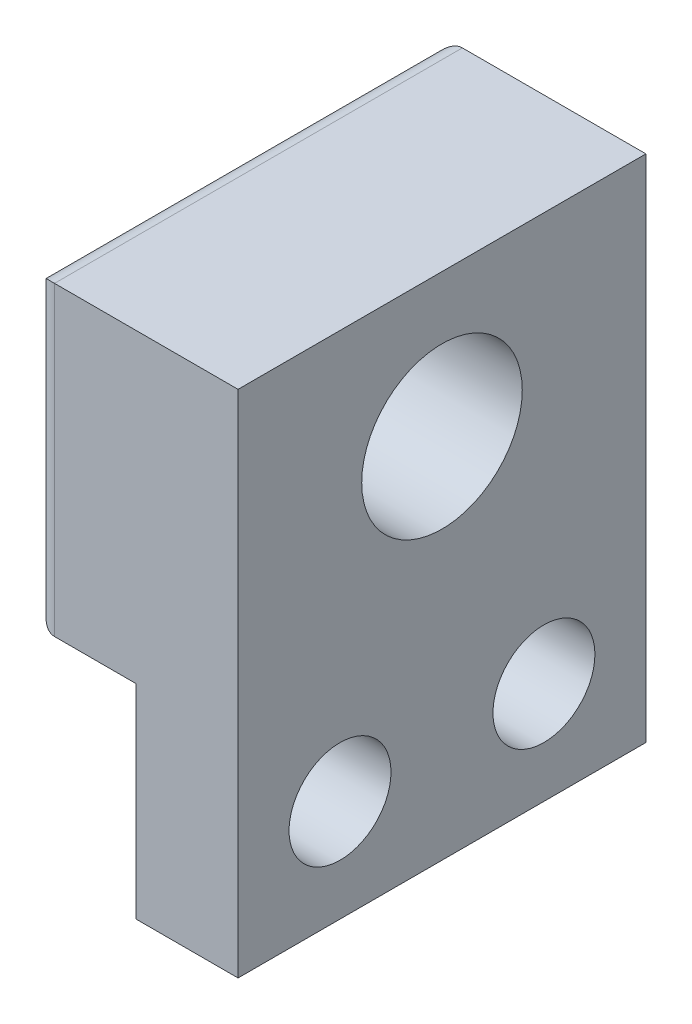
ISO-10303-21;
HEADER;
FILE_DESCRIPTION(('STEP AP214'),'2;1');
FILE_NAME('part.step','',(''),(''),'','','');
FILE_SCHEMA(('AUTOMOTIVE_DESIGN { 1 0 10303 214 1 1 1 1 }'));
ENDSEC;
DATA;
#1=APPLICATION_CONTEXT('core data for automotive mechanical design processes');
#2=APPLICATION_PROTOCOL_DEFINITION('international standard','automotive_design',2000,#1);
#3=PRODUCT_CONTEXT('',#1,'mechanical');
#4=PRODUCT('Part','Part','',(#3));
#5=PRODUCT_RELATED_PRODUCT_CATEGORY('part','',(#4));
#6=PRODUCT_DEFINITION_FORMATION('','',#4);
#7=PRODUCT_DEFINITION_CONTEXT('part definition',#1,'design');
#8=PRODUCT_DEFINITION('design','',#6,#7);
#9=PRODUCT_DEFINITION_SHAPE('','',#8);
#10=(LENGTH_UNIT() NAMED_UNIT(*) SI_UNIT(.MILLI.,.METRE.));
#11=(NAMED_UNIT(*) PLANE_ANGLE_UNIT() SI_UNIT($,.RADIAN.));
#12=(NAMED_UNIT(*) SI_UNIT($,.STERADIAN.) SOLID_ANGLE_UNIT());
#13=UNCERTAINTY_MEASURE_WITH_UNIT(LENGTH_MEASURE(1.E-05),#10,'distance_accuracy_value','');
#14=(GEOMETRIC_REPRESENTATION_CONTEXT(3) GLOBAL_UNCERTAINTY_ASSIGNED_CONTEXT((#13)) GLOBAL_UNIT_ASSIGNED_CONTEXT((#10,
#11,#12)) REPRESENTATION_CONTEXT('',''));
#15=CARTESIAN_POINT('',(0.,0.,0.));
#16=DIRECTION('',(0.,0.,1.));
#17=DIRECTION('',(1.,0.,0.));
#18=AXIS2_PLACEMENT_3D('',#15,#16,#17);
#19=CARTESIAN_POINT('',(-12.7,0.,-25.4));
#20=DIRECTION('',(1.,0.,0.));
#21=DIRECTION('',(0.,0.,-1.));
#22=AXIS2_PLACEMENT_3D('',#19,#20,#21);
#23=PLANE('',#22);
#24=DIRECTION('',(0.,0.,1.));
#25=VECTOR('',#24,1.);
#26=CARTESIAN_POINT('',(-12.7,1.27,-25.4));
#27=LINE('',#26,#25);
#28=CARTESIAN_POINT('',(-12.7,1.27,-24.13));
#29=VERTEX_POINT('',#28);
#30=CARTESIAN_POINT('',(-12.7,1.27,-1.27));
#31=VERTEX_POINT('',#30);
#32=EDGE_CURVE('E170',#29,#31,#27,.T.);
#33=ORIENTED_EDGE('',*,*,#32,.T.);
#34=DIRECTION('',(0.,1.,0.));
#35=VECTOR('',#34,1.);
#36=CARTESIAN_POINT('',(-12.7,19.05,-1.27));
#37=LINE('',#36,#35);
#38=CARTESIAN_POINT('',(-12.7,17.78,-1.27));
#39=VERTEX_POINT('',#38);
#40=EDGE_CURVE('E172',#31,#39,#37,.T.);
#41=ORIENTED_EDGE('',*,*,#40,.T.);
#42=DIRECTION('',(0.,0.,1.));
#43=VECTOR('',#42,1.);
#44=CARTESIAN_POINT('',(-12.7,17.78,-25.4));
#45=LINE('',#44,#43);
#46=CARTESIAN_POINT('',(-12.7,17.78,-24.13));
#47=VERTEX_POINT('',#46);
#48=EDGE_CURVE('E155',#39,#47,#45,.F.);
#49=ORIENTED_EDGE('',*,*,#48,.T.);
#50=DIRECTION('',(0.,1.,0.));
#51=VECTOR('',#50,1.);
#52=CARTESIAN_POINT('',(-12.7,0.,-24.13));
#53=LINE('',#52,#51);
#54=EDGE_CURVE('E168',#47,#29,#53,.F.);
#55=ORIENTED_EDGE('',*,*,#54,.T.);
#56=EDGE_LOOP('',(#33,#41,#49,#55));
#57=FACE_BOUND('',#56,.T.);
#58=CARTESIAN_POINT('',(-12.7,10.16,-12.7));
#59=DIRECTION('',(1.,0.,0.));
#60=DIRECTION('',(0.,0.,-1.));
#61=AXIS2_PLACEMENT_3D('',#58,#59,#60);
#62=CIRCLE('',#61,5.);
#63=CARTESIAN_POINT('',(-12.7,10.16,-17.7));
#64=VERTEX_POINT('',#63);
#65=EDGE_CURVE('E143',#64,#64,#62,.T.);
#66=ORIENTED_EDGE('',*,*,#65,.T.);
#67=EDGE_LOOP('',(#66));
#68=FACE_BOUND('',#67,.T.);
#69=ADVANCED_FACE('F46',(#57,#68),#23,.F.);
#70=CARTESIAN_POINT('',(0.,19.05,-25.4));
#71=DIRECTION('',(0.,1.,0.));
#72=DIRECTION('',(-1.,0.,0.));
#73=AXIS2_PLACEMENT_3D('',#70,#71,#72);
#74=PLANE('',#73);
#75=DIRECTION('',(-1.,0.,0.));
#76=VECTOR('',#75,1.);
#77=CARTESIAN_POINT('',(0.,19.05,-25.4));
#78=LINE('',#77,#76);
#79=CARTESIAN_POINT('',(0.,19.05,-25.4));
#80=VERTEX_POINT('',#79);
#81=CARTESIAN_POINT('',(-11.43,19.05,-25.4));
#82=VERTEX_POINT('',#81);
#83=EDGE_CURVE('E122',#80,#82,#78,.T.);
#84=ORIENTED_EDGE('',*,*,#83,.T.);
#85=DIRECTION('',(0.,0.,1.));
#86=VECTOR('',#85,1.);
#87=CARTESIAN_POINT('',(-11.43,19.05,0.));
#88=LINE('',#87,#86);
#89=CARTESIAN_POINT('',(-11.43,19.05,0.));
#90=VERTEX_POINT('',#89);
#91=EDGE_CURVE('E13',#82,#90,#88,.T.);
#92=ORIENTED_EDGE('',*,*,#91,.T.);
#93=DIRECTION('',(-1.,0.,0.));
#94=VECTOR('',#93,1.);
#95=CARTESIAN_POINT('',(0.,19.05,0.));
#96=LINE('',#95,#94);
#97=CARTESIAN_POINT('',(0.,19.05,0.));
#98=VERTEX_POINT('',#97);
#99=EDGE_CURVE('E126',#98,#90,#96,.T.);
#100=ORIENTED_EDGE('',*,*,#99,.F.);
#101=DIRECTION('',(0.,0.,1.));
#102=VECTOR('',#101,1.);
#103=CARTESIAN_POINT('',(0.,19.05,-25.4));
#104=LINE('',#103,#102);
#105=EDGE_CURVE('E153',#80,#98,#104,.T.);
#106=ORIENTED_EDGE('',*,*,#105,.F.);
#107=EDGE_LOOP('',(#84,#92,#100,#106));
#108=FACE_BOUND('',#107,.T.);
#109=ADVANCED_FACE('F211',(#108),#74,.T.);
#110=CARTESIAN_POINT('',(0.,0.,-25.4));
#111=DIRECTION('',(1.,0.,0.));
#112=DIRECTION('',(0.,1.,0.));
#113=AXIS2_PLACEMENT_3D('',#110,#111,#112);
#114=PLANE('',#113);
#115=CARTESIAN_POINT('',(0.,-6.35,-6.35));
#116=DIRECTION('',(1.,0.,0.));
#117=DIRECTION('',(0.,0.,-1.));
#118=AXIS2_PLACEMENT_3D('',#115,#116,#117);
#119=CIRCLE('',#118,3.175);
#120=CARTESIAN_POINT('',(0.,-6.35,-9.525));
#121=VERTEX_POINT('',#120);
#122=EDGE_CURVE('E163',#121,#121,#119,.T.);
#123=ORIENTED_EDGE('',*,*,#122,.F.);
#124=EDGE_LOOP('',(#123));
#125=FACE_BOUND('',#124,.T.);
#126=CARTESIAN_POINT('',(0.,-6.35,-19.05));
#127=DIRECTION('',(1.,0.,0.));
#128=DIRECTION('',(0.,0.,-1.));
#129=AXIS2_PLACEMENT_3D('',#126,#127,#128);
#130=CIRCLE('',#129,3.175);
#131=CARTESIAN_POINT('',(0.,-6.35,-22.225));
#132=VERTEX_POINT('',#131);
#133=EDGE_CURVE('E190',#132,#132,#130,.T.);
#134=ORIENTED_EDGE('',*,*,#133,.F.);
#135=EDGE_LOOP('',(#134));
#136=FACE_BOUND('',#135,.T.);
#137=CARTESIAN_POINT('',(0.,10.16,-12.7));
#138=DIRECTION('',(1.,0.,0.));
#139=DIRECTION('',(0.,0.,-1.));
#140=AXIS2_PLACEMENT_3D('',#137,#138,#139);
#141=CIRCLE('',#140,5.);
#142=CARTESIAN_POINT('',(0.,10.16,-17.7));
#143=VERTEX_POINT('',#142);
#144=EDGE_CURVE('E166',#143,#143,#141,.T.);
#145=ORIENTED_EDGE('',*,*,#144,.F.);
#146=EDGE_LOOP('',(#145));
#147=FACE_BOUND('',#146,.T.);
#148=DIRECTION('',(0.,1.,0.));
#149=VECTOR('',#148,1.);
#150=CARTESIAN_POINT('',(0.,0.,0.));
#151=LINE('',#150,#149);
#152=CARTESIAN_POINT('',(0.,-12.7,0.));
#153=VERTEX_POINT('',#152);
#154=EDGE_CURVE('E148',#153,#98,#151,.T.);
#155=ORIENTED_EDGE('',*,*,#154,.F.);
#156=DIRECTION('',(0.,0.,1.));
#157=VECTOR('',#156,1.);
#158=CARTESIAN_POINT('',(0.,-12.7,-25.4));
#159=LINE('',#158,#157);
#160=CARTESIAN_POINT('',(0.,-12.7,-25.4));
#161=VERTEX_POINT('',#160);
#162=EDGE_CURVE('E156',#161,#153,#159,.T.);
#163=ORIENTED_EDGE('',*,*,#162,.F.);
#164=DIRECTION('',(0.,1.,0.));
#165=VECTOR('',#164,1.);
#166=CARTESIAN_POINT('',(0.,0.,-25.4));
#167=LINE('',#166,#165);
#168=EDGE_CURVE('E134',#161,#80,#167,.T.);
#169=ORIENTED_EDGE('',*,*,#168,.T.);
#170=ORIENTED_EDGE('',*,*,#105,.T.);
#171=EDGE_LOOP('',(#155,#163,#169,#170));
#172=FACE_BOUND('',#171,.T.);
#173=ADVANCED_FACE('F207',(#125,#136,#147,#172),#114,.T.);
#174=CARTESIAN_POINT('',(0.,-12.7,-25.4));
#175=DIRECTION('',(0.,1.,0.));
#176=DIRECTION('',(0.,0.,1.));
#177=AXIS2_PLACEMENT_3D('',#174,#175,#176);
#178=PLANE('',#177);
#179=DIRECTION('',(-1.,0.,0.));
#180=VECTOR('',#179,1.);
#181=CARTESIAN_POINT('',(0.,-12.7,0.));
#182=LINE('',#181,#180);
#183=CARTESIAN_POINT('',(-6.35,-12.7,0.));
#184=VERTEX_POINT('',#183);
#185=EDGE_CURVE('E145',#153,#184,#182,.T.);
#186=ORIENTED_EDGE('',*,*,#185,.T.);
#187=DIRECTION('',(0.,0.,1.));
#188=VECTOR('',#187,1.);
#189=CARTESIAN_POINT('',(-6.35,-12.7,-25.4));
#190=LINE('',#189,#188);
#191=CARTESIAN_POINT('',(-6.35,-12.7,-25.4));
#192=VERTEX_POINT('',#191);
#193=EDGE_CURVE('E121',#192,#184,#190,.T.);
#194=ORIENTED_EDGE('',*,*,#193,.F.);
#195=DIRECTION('',(-1.,0.,0.));
#196=VECTOR('',#195,1.);
#197=CARTESIAN_POINT('',(0.,-12.7,-25.4));
#198=LINE('',#197,#196);
#199=EDGE_CURVE('E131',#161,#192,#198,.T.);
#200=ORIENTED_EDGE('',*,*,#199,.F.);
#201=ORIENTED_EDGE('',*,*,#162,.T.);
#202=EDGE_LOOP('',(#186,#194,#200,#201));
#203=FACE_BOUND('',#202,.T.);
#204=ADVANCED_FACE('F210',(#203),#178,.F.);
#205=CARTESIAN_POINT('',(-6.35,0.,-25.4));
#206=DIRECTION('',(-1.,0.,0.));
#207=DIRECTION('',(0.,-1.,0.));
#208=AXIS2_PLACEMENT_3D('',#205,#206,#207);
#209=PLANE('',#208);
#210=CARTESIAN_POINT('',(-6.35,-6.35,-6.35));
#211=DIRECTION('',(-1.,0.,0.));
#212=DIRECTION('',(0.,-1.,0.));
#213=AXIS2_PLACEMENT_3D('',#210,#211,#212);
#214=CIRCLE('',#213,3.175);
#215=CARTESIAN_POINT('',(-6.35,-9.525,-6.35));
#216=VERTEX_POINT('',#215);
#217=EDGE_CURVE('E162',#216,#216,#214,.T.);
#218=ORIENTED_EDGE('',*,*,#217,.F.);
#219=EDGE_LOOP('',(#218));
#220=FACE_BOUND('',#219,.T.);
#221=CARTESIAN_POINT('',(-6.35,-6.35,-19.05));
#222=DIRECTION('',(-1.,0.,0.));
#223=DIRECTION('',(0.,-1.,0.));
#224=AXIS2_PLACEMENT_3D('',#221,#222,#223);
#225=CIRCLE('',#224,3.175);
#226=CARTESIAN_POINT('',(-6.35,-9.525,-19.05));
#227=VERTEX_POINT('',#226);
#228=EDGE_CURVE('E159',#227,#227,#225,.T.);
#229=ORIENTED_EDGE('',*,*,#228,.F.);
#230=EDGE_LOOP('',(#229));
#231=FACE_BOUND('',#230,.T.);
#232=DIRECTION('',(0.,-1.,0.));
#233=VECTOR('',#232,1.);
#234=CARTESIAN_POINT('',(-6.35,0.,0.));
#235=LINE('',#234,#233);
#236=CARTESIAN_POINT('',(-6.35,0.,0.));
#237=VERTEX_POINT('',#236);
#238=EDGE_CURVE('E119',#237,#184,#235,.T.);
#239=ORIENTED_EDGE('',*,*,#238,.F.);
#240=DIRECTION('',(0.,0.,1.));
#241=VECTOR('',#240,1.);
#242=CARTESIAN_POINT('',(-6.35,0.,-25.4));
#243=LINE('',#242,#241);
#244=CARTESIAN_POINT('',(-6.35,0.,-25.4));
#245=VERTEX_POINT('',#244);
#246=EDGE_CURVE('E114',#245,#237,#243,.T.);
#247=ORIENTED_EDGE('',*,*,#246,.F.);
#248=DIRECTION('',(0.,-1.,0.));
#249=VECTOR('',#248,1.);
#250=CARTESIAN_POINT('',(-6.35,0.,-25.4));
#251=LINE('',#250,#249);
#252=EDGE_CURVE('E117',#245,#192,#251,.T.);
#253=ORIENTED_EDGE('',*,*,#252,.T.);
#254=ORIENTED_EDGE('',*,*,#193,.T.);
#255=EDGE_LOOP('',(#239,#247,#253,#254));
#256=FACE_BOUND('',#255,.T.);
#257=ADVANCED_FACE('F115',(#220,#231,#256),#209,.T.);
#258=CARTESIAN_POINT('',(0.,0.,-25.4));
#259=DIRECTION('',(0.,1.,0.));
#260=DIRECTION('',(-1.,0.,0.));
#261=AXIS2_PLACEMENT_3D('',#258,#259,#260);
#262=PLANE('',#261);
#263=DIRECTION('',(-1.,0.,0.));
#264=VECTOR('',#263,1.);
#265=CARTESIAN_POINT('',(0.,0.,0.));
#266=LINE('',#265,#264);
#267=CARTESIAN_POINT('',(-11.43,0.,0.));
#268=VERTEX_POINT('',#267);
#269=EDGE_CURVE('E141',#237,#268,#266,.T.);
#270=ORIENTED_EDGE('',*,*,#269,.T.);
#271=DIRECTION('',(0.,0.,1.));
#272=VECTOR('',#271,1.);
#273=CARTESIAN_POINT('',(-11.43,0.,-25.4));
#274=LINE('',#273,#272);
#275=CARTESIAN_POINT('',(-11.43,0.,-25.4));
#276=VERTEX_POINT('',#275);
#277=EDGE_CURVE('E70',#268,#276,#274,.F.);
#278=ORIENTED_EDGE('',*,*,#277,.T.);
#279=DIRECTION('',(-1.,0.,0.));
#280=VECTOR('',#279,1.);
#281=CARTESIAN_POINT('',(0.,0.,-25.4));
#282=LINE('',#281,#280);
#283=EDGE_CURVE('E124',#245,#276,#282,.T.);
#284=ORIENTED_EDGE('',*,*,#283,.F.);
#285=ORIENTED_EDGE('',*,*,#246,.T.);
#286=EDGE_LOOP('',(#270,#278,#284,#285));
#287=FACE_BOUND('',#286,.T.);
#288=ADVANCED_FACE('F125',(#287),#262,.F.);
#289=CARTESIAN_POINT('',(0.,0.,-25.4));
#290=DIRECTION('',(0.,0.,1.));
#291=DIRECTION('',(1.,0.,0.));
#292=AXIS2_PLACEMENT_3D('',#289,#290,#291);
#293=PLANE('',#292);
#294=ORIENTED_EDGE('',*,*,#283,.T.);
#295=DIRECTION('',(0.,1.,0.));
#296=VECTOR('',#295,1.);
#297=CARTESIAN_POINT('',(-11.43,0.,-25.4));
#298=LINE('',#297,#296);
#299=EDGE_CURVE('E55',#276,#82,#298,.T.);
#300=ORIENTED_EDGE('',*,*,#299,.T.);
#301=ORIENTED_EDGE('',*,*,#83,.F.);
#302=ORIENTED_EDGE('',*,*,#168,.F.);
#303=ORIENTED_EDGE('',*,*,#199,.T.);
#304=ORIENTED_EDGE('',*,*,#252,.F.);
#305=EDGE_LOOP('',(#294,#300,#301,#302,#303,#304));
#306=FACE_BOUND('',#305,.T.);
#307=ADVANCED_FACE('F128',(#306),#293,.F.);
#308=CARTESIAN_POINT('',(0.,0.,0.));
#309=DIRECTION('',(0.,0.,1.));
#310=DIRECTION('',(1.,0.,0.));
#311=AXIS2_PLACEMENT_3D('',#308,#309,#310);
#312=PLANE('',#311);
#313=ORIENTED_EDGE('',*,*,#99,.T.);
#314=DIRECTION('',(0.,1.,0.));
#315=VECTOR('',#314,1.);
#316=CARTESIAN_POINT('',(-11.43,0.,0.));
#317=LINE('',#316,#315);
#318=EDGE_CURVE('E175',#90,#268,#317,.F.);
#319=ORIENTED_EDGE('',*,*,#318,.T.);
#320=ORIENTED_EDGE('',*,*,#269,.F.);
#321=ORIENTED_EDGE('',*,*,#238,.T.);
#322=ORIENTED_EDGE('',*,*,#185,.F.);
#323=ORIENTED_EDGE('',*,*,#154,.T.);
#324=EDGE_LOOP('',(#313,#319,#320,#321,#322,#323));
#325=FACE_BOUND('',#324,.T.);
#326=ADVANCED_FACE('F218',(#325),#312,.T.);
#327=CARTESIAN_POINT('',(-12.7,10.16,-12.7));
#328=DIRECTION('',(1.,0.,0.));
#329=DIRECTION('',(0.,0.,-1.));
#330=AXIS2_PLACEMENT_3D('',#327,#328,#329);
#331=CYLINDRICAL_SURFACE('',#330,5.);
#332=ORIENTED_EDGE('',*,*,#65,.F.);
#333=EDGE_LOOP('',(#332));
#334=FACE_BOUND('',#333,.T.);
#335=ORIENTED_EDGE('',*,*,#144,.T.);
#336=EDGE_LOOP('',(#335));
#337=FACE_BOUND('',#336,.T.);
#338=ADVANCED_FACE('F205',(#334,#337),#331,.F.);
#339=CARTESIAN_POINT('',(-12.7,-6.35,-19.05));
#340=DIRECTION('',(1.,0.,0.));
#341=DIRECTION('',(0.,0.,-1.));
#342=AXIS2_PLACEMENT_3D('',#339,#340,#341);
#343=CYLINDRICAL_SURFACE('',#342,3.175);
#344=ORIENTED_EDGE('',*,*,#228,.T.);
#345=EDGE_LOOP('',(#344));
#346=FACE_BOUND('',#345,.T.);
#347=ORIENTED_EDGE('',*,*,#133,.T.);
#348=EDGE_LOOP('',(#347));
#349=FACE_BOUND('',#348,.T.);
#350=ADVANCED_FACE('F313',(#346,#349),#343,.F.);
#351=CARTESIAN_POINT('',(-12.7,-6.35,-6.35));
#352=DIRECTION('',(1.,0.,0.));
#353=DIRECTION('',(0.,0.,-1.));
#354=AXIS2_PLACEMENT_3D('',#351,#352,#353);
#355=CYLINDRICAL_SURFACE('',#354,3.175);
#356=ORIENTED_EDGE('',*,*,#217,.T.);
#357=EDGE_LOOP('',(#356));
#358=FACE_BOUND('',#357,.T.);
#359=ORIENTED_EDGE('',*,*,#122,.T.);
#360=EDGE_LOOP('',(#359));
#361=FACE_BOUND('',#360,.T.);
#362=ADVANCED_FACE('F234',(#358,#361),#355,.F.);
#363=CARTESIAN_POINT('',(-11.43,0.,-24.13));
#364=DIRECTION('',(0.,1.,0.));
#365=DIRECTION('',(0.,0.,1.));
#366=AXIS2_PLACEMENT_3D('',#363,#364,#365);
#367=CYLINDRICAL_SURFACE('',#366,1.27);
#368=CARTESIAN_POINT('',(-11.43,17.78,-24.13));
#369=DIRECTION('',(0.,-0.707106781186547,-0.707106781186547));
#370=DIRECTION('',(0.,0.707106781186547,-0.707106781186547));
#371=AXIS2_PLACEMENT_3D('',#368,#369,#370);
#372=ELLIPSE('',#371,1.79605122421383,1.27);
#373=EDGE_CURVE('E183',#82,#47,#372,.F.);
#374=ORIENTED_EDGE('',*,*,#373,.F.);
#375=ORIENTED_EDGE('',*,*,#299,.F.);
#376=CARTESIAN_POINT('',(-11.43,1.27,-24.13));
#377=DIRECTION('',(0.,0.707106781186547,-0.707106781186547));
#378=DIRECTION('',(0.,0.707106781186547,0.707106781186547));
#379=AXIS2_PLACEMENT_3D('',#376,#377,#378);
#380=ELLIPSE('',#379,1.79605122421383,1.27);
#381=EDGE_CURVE('E50',#29,#276,#380,.F.);
#382=ORIENTED_EDGE('',*,*,#381,.F.);
#383=ORIENTED_EDGE('',*,*,#54,.F.);
#384=EDGE_LOOP('',(#374,#375,#382,#383));
#385=FACE_BOUND('',#384,.T.);
#386=ADVANCED_FACE('F48',(#385),#367,.T.);
#387=CARTESIAN_POINT('',(-11.43,1.27,-25.4));
#388=DIRECTION('',(0.,0.,1.));
#389=DIRECTION('',(1.,0.,0.));
#390=AXIS2_PLACEMENT_3D('',#387,#388,#389);
#391=CYLINDRICAL_SURFACE('',#390,1.27);
#392=ORIENTED_EDGE('',*,*,#381,.T.);
#393=ORIENTED_EDGE('',*,*,#277,.F.);
#394=CARTESIAN_POINT('',(-11.43,1.27,-1.27));
#395=DIRECTION('',(0.,0.707106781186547,0.707106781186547));
#396=DIRECTION('',(0.,-0.707106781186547,0.707106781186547));
#397=AXIS2_PLACEMENT_3D('',#394,#395,#396);
#398=ELLIPSE('',#397,1.79605122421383,1.27);
#399=EDGE_CURVE('E182',#31,#268,#398,.T.);
#400=ORIENTED_EDGE('',*,*,#399,.F.);
#401=ORIENTED_EDGE('',*,*,#32,.F.);
#402=EDGE_LOOP('',(#392,#393,#400,#401));
#403=FACE_BOUND('',#402,.T.);
#404=ADVANCED_FACE('F227',(#403),#391,.T.);
#405=CARTESIAN_POINT('',(-11.43,17.78,-25.4));
#406=DIRECTION('',(0.,0.,-1.));
#407=DIRECTION('',(-1.,0.,0.));
#408=AXIS2_PLACEMENT_3D('',#405,#406,#407);
#409=CYLINDRICAL_SURFACE('',#408,1.27);
#410=ORIENTED_EDGE('',*,*,#373,.T.);
#411=ORIENTED_EDGE('',*,*,#48,.F.);
#412=CARTESIAN_POINT('',(-11.43,17.78,-1.27));
#413=DIRECTION('',(0.,0.707106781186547,-0.707106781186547));
#414=DIRECTION('',(0.,-0.707106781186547,-0.707106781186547));
#415=AXIS2_PLACEMENT_3D('',#412,#413,#414);
#416=ELLIPSE('',#415,1.79605122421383,1.27);
#417=EDGE_CURVE('E180',#90,#39,#416,.F.);
#418=ORIENTED_EDGE('',*,*,#417,.F.);
#419=ORIENTED_EDGE('',*,*,#91,.F.);
#420=EDGE_LOOP('',(#410,#411,#418,#419));
#421=FACE_BOUND('',#420,.T.);
#422=ADVANCED_FACE('F222',(#421),#409,.T.);
#423=CARTESIAN_POINT('',(-11.43,0.,-1.27));
#424=DIRECTION('',(0.,-1.,0.));
#425=DIRECTION('',(0.,0.,-1.));
#426=AXIS2_PLACEMENT_3D('',#423,#424,#425);
#427=CYLINDRICAL_SURFACE('',#426,1.27);
#428=ORIENTED_EDGE('',*,*,#399,.T.);
#429=ORIENTED_EDGE('',*,*,#318,.F.);
#430=ORIENTED_EDGE('',*,*,#417,.T.);
#431=ORIENTED_EDGE('',*,*,#40,.F.);
#432=EDGE_LOOP('',(#428,#429,#430,#431));
#433=FACE_BOUND('',#432,.T.);
#434=ADVANCED_FACE('F225',(#433),#427,.T.);
#435=CLOSED_SHELL('',(#69,#109,#173,#204,#257,#288,#307,#326,#338,#350,#362,#386,#404,#422,#434));
#436=MANIFOLD_SOLID_BREP('B2',#435);
#437=ADVANCED_BREP_SHAPE_REPRESENTATION('',(#18,#436),#14);
#438=SHAPE_DEFINITION_REPRESENTATION(#9,#437);
ENDSEC;
END-ISO-10303-21;
